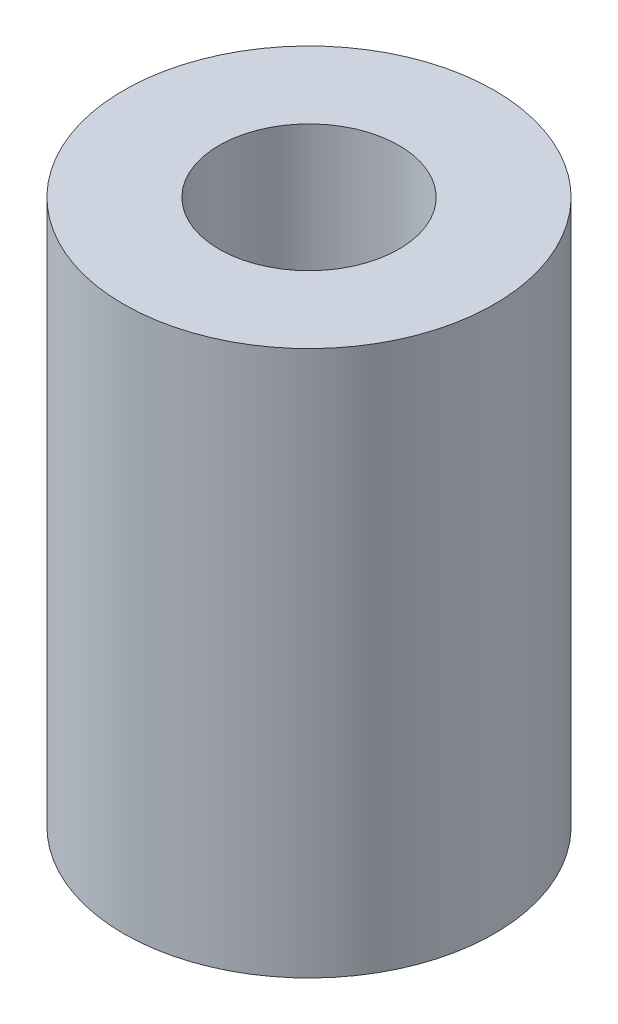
ISO-10303-21;
HEADER;
FILE_DESCRIPTION(('STEP AP214'),'2;1');
FILE_NAME('part.step','',(''),(''),'','','');
FILE_SCHEMA(('AUTOMOTIVE_DESIGN { 1 0 10303 214 1 1 1 1 }'));
ENDSEC;
DATA;
#1=APPLICATION_CONTEXT('core data for automotive mechanical design processes');
#2=APPLICATION_PROTOCOL_DEFINITION('international standard','automotive_design',2000,#1);
#3=PRODUCT_CONTEXT('',#1,'mechanical');
#4=PRODUCT('Part','Part','',(#3));
#5=PRODUCT_RELATED_PRODUCT_CATEGORY('part','',(#4));
#6=PRODUCT_DEFINITION_FORMATION('','',#4);
#7=PRODUCT_DEFINITION_CONTEXT('part definition',#1,'design');
#8=PRODUCT_DEFINITION('design','',#6,#7);
#9=PRODUCT_DEFINITION_SHAPE('','',#8);
#10=(LENGTH_UNIT() NAMED_UNIT(*) SI_UNIT(.MILLI.,.METRE.));
#11=(NAMED_UNIT(*) PLANE_ANGLE_UNIT() SI_UNIT($,.RADIAN.));
#12=(NAMED_UNIT(*) SI_UNIT($,.STERADIAN.) SOLID_ANGLE_UNIT());
#13=UNCERTAINTY_MEASURE_WITH_UNIT(LENGTH_MEASURE(1.E-05),#10,'distance_accuracy_value','');
#14=(GEOMETRIC_REPRESENTATION_CONTEXT(3) GLOBAL_UNCERTAINTY_ASSIGNED_CONTEXT((#13)) GLOBAL_UNIT_ASSIGNED_CONTEXT((#10,
#11,#12)) REPRESENTATION_CONTEXT('',''));
#15=CARTESIAN_POINT('',(0.,0.,0.));
#16=DIRECTION('',(0.,0.,1.));
#17=DIRECTION('',(1.,0.,0.));
#18=AXIS2_PLACEMENT_3D('',#15,#16,#17);
#19=CARTESIAN_POINT('',(0.,10.,0.));
#20=DIRECTION('',(0.,1.,0.));
#21=DIRECTION('',(0.,0.,1.));
#22=AXIS2_PLACEMENT_3D('',#19,#20,#21);
#23=PLANE('',#22);
#24=CARTESIAN_POINT('',(0.,10.,0.));
#25=DIRECTION('',(0.,1.,0.));
#26=DIRECTION('',(0.,0.,1.));
#27=AXIS2_PLACEMENT_3D('',#24,#25,#26);
#28=CIRCLE('',#27,3.4);
#29=CARTESIAN_POINT('',(0.,10.,3.4));
#30=VERTEX_POINT('',#29);
#31=EDGE_CURVE('E10',#30,#30,#28,.T.);
#32=ORIENTED_EDGE('',*,*,#31,.T.);
#33=EDGE_LOOP('',(#32));
#34=FACE_BOUND('',#33,.T.);
#35=CARTESIAN_POINT('',(0.,10.,0.));
#36=DIRECTION('',(0.,1.,0.));
#37=DIRECTION('',(0.,0.,1.));
#38=AXIS2_PLACEMENT_3D('',#35,#36,#37);
#39=CIRCLE('',#38,1.65);
#40=CARTESIAN_POINT('',(0.,10.,1.65));
#41=VERTEX_POINT('',#40);
#42=EDGE_CURVE('E42',#41,#41,#39,.T.);
#43=ORIENTED_EDGE('',*,*,#42,.F.);
#44=EDGE_LOOP('',(#43));
#45=FACE_BOUND('',#44,.T.);
#46=ADVANCED_FACE('F31',(#34,#45),#23,.T.);
#47=CARTESIAN_POINT('',(0.,0.,0.));
#48=DIRECTION('',(0.,1.,0.));
#49=DIRECTION('',(0.,0.,1.));
#50=AXIS2_PLACEMENT_3D('',#47,#48,#49);
#51=PLANE('',#50);
#52=CARTESIAN_POINT('',(0.,0.,0.));
#53=DIRECTION('',(0.,1.,0.));
#54=DIRECTION('',(0.,0.,1.));
#55=AXIS2_PLACEMENT_3D('',#52,#53,#54);
#56=CIRCLE('',#55,3.4);
#57=CARTESIAN_POINT('',(0.,0.,3.4));
#58=VERTEX_POINT('',#57);
#59=EDGE_CURVE('E35',#58,#58,#56,.T.);
#60=ORIENTED_EDGE('',*,*,#59,.F.);
#61=EDGE_LOOP('',(#60));
#62=FACE_BOUND('',#61,.T.);
#63=CARTESIAN_POINT('',(0.,0.,0.));
#64=DIRECTION('',(0.,1.,0.));
#65=DIRECTION('',(0.,0.,1.));
#66=AXIS2_PLACEMENT_3D('',#63,#64,#65);
#67=CIRCLE('',#66,1.65);
#68=CARTESIAN_POINT('',(0.,0.,1.65));
#69=VERTEX_POINT('',#68);
#70=EDGE_CURVE('E44',#69,#69,#67,.T.);
#71=ORIENTED_EDGE('',*,*,#70,.T.);
#72=EDGE_LOOP('',(#71));
#73=FACE_BOUND('',#72,.T.);
#74=ADVANCED_FACE('F54',(#62,#73),#51,.F.);
#75=CARTESIAN_POINT('',(0.,10.,0.));
#76=DIRECTION('',(0.,-1.,0.));
#77=DIRECTION('',(0.,0.,-1.));
#78=AXIS2_PLACEMENT_3D('',#75,#76,#77);
#79=CYLINDRICAL_SURFACE('',#78,3.4);
#80=ORIENTED_EDGE('',*,*,#31,.F.);
#81=EDGE_LOOP('',(#80));
#82=FACE_BOUND('',#81,.T.);
#83=ORIENTED_EDGE('',*,*,#59,.T.);
#84=EDGE_LOOP('',(#83));
#85=FACE_BOUND('',#84,.T.);
#86=ADVANCED_FACE('F33',(#82,#85),#79,.T.);
#87=CARTESIAN_POINT('',(0.,10.,0.));
#88=DIRECTION('',(0.,-1.,0.));
#89=DIRECTION('',(0.,0.,-1.));
#90=AXIS2_PLACEMENT_3D('',#87,#88,#89);
#91=CYLINDRICAL_SURFACE('',#90,1.65);
#92=ORIENTED_EDGE('',*,*,#42,.T.);
#93=EDGE_LOOP('',(#92));
#94=FACE_BOUND('',#93,.T.);
#95=ORIENTED_EDGE('',*,*,#70,.F.);
#96=EDGE_LOOP('',(#95));
#97=FACE_BOUND('',#96,.T.);
#98=ADVANCED_FACE('F50',(#94,#97),#91,.F.);
#99=CLOSED_SHELL('',(#46,#74,#86,#98));
#100=MANIFOLD_SOLID_BREP('B2',#99);
#101=ADVANCED_BREP_SHAPE_REPRESENTATION('',(#18,#100),#14);
#102=SHAPE_DEFINITION_REPRESENTATION(#9,#101);
ENDSEC;
END-ISO-10303-21;
